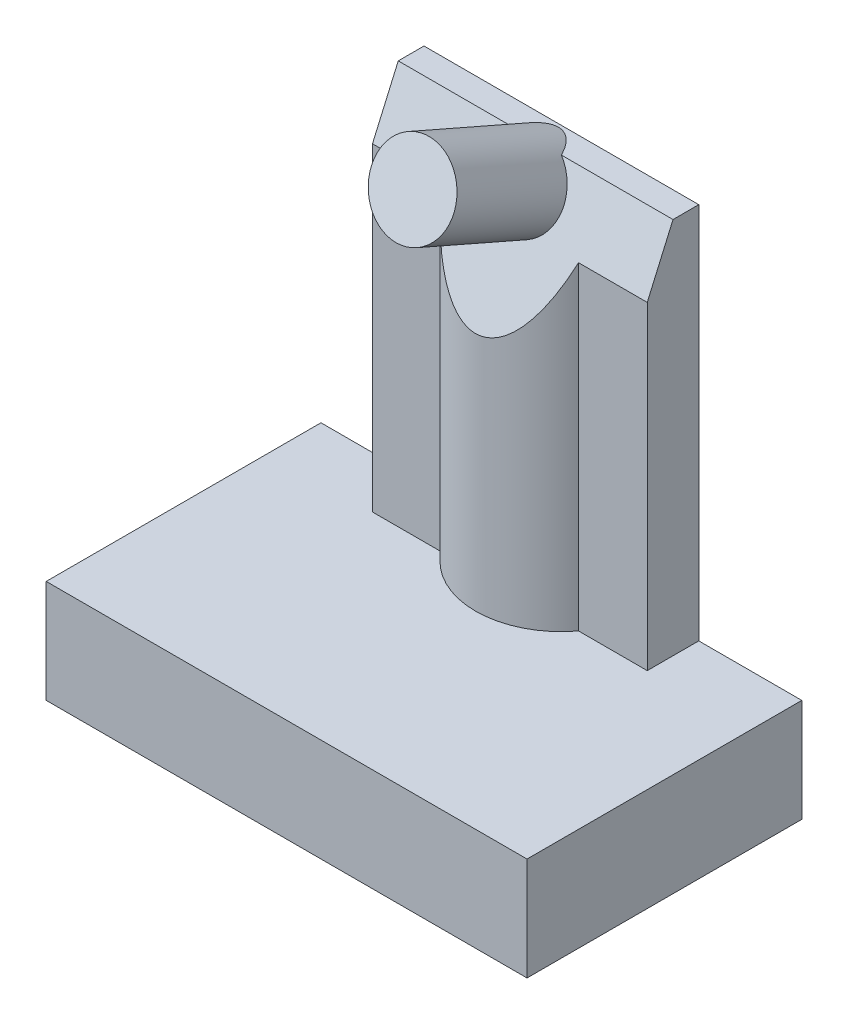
from build123d import *

# Parameters (mm, degrees)
CROQUIS1_W                          = 14
CROQUIS1_H                          = 8
SALIENTE_EXTRUIR1_DEPTH             = 3
VACIADO1_T                          = -1
CROQUIS2_R                          = 1.5
CROQUIS2_R_2                        = 0.8
SALIENTE_EXTRUIR2_DEPTH             = 2
SALIENTE_EXTRUIR4_DEPTH             = 11
CORTAR_EXTRUIR1_REACH               = 20.248
SALIENTE_EXTRUIR5_REACH             = 18.052
CROQUIS9_R                          = 1.2
SALIENTE_EXTRUIR5_DIRECTION_2_DEPTH = 3.5


with BuildPart() as part:
    # Croquis1 → Saliente-Extruir1 (new body)
    with BuildSketch(Plane(origin=(0, 0, 0), x_dir=(1, 0, 0), z_dir=(0, 1, 0))):
        Rectangle(CROQUIS1_W, CROQUIS1_H)
    extrude(amount=SALIENTE_EXTRUIR1_DEPTH)

    # Vaciado1
    vaciado1_openings = [part.faces().sort_by_distance(p)[0] for p in [
        (0, 0, 0),
    ]]
    offset(amount=VACIADO1_T, openings=vaciado1_openings, kind=Kind.INTERSECTION)

    # Croquis2 → Saliente-Extruir2 (add)
    with BuildSketch(Plane.XZ.offset(-2)):
        with Locations(Location((0, 0, 0), (0, 0, 90))):
            Circle(CROQUIS2_R)
        with Locations(Location((0, 0, 0), (0, 0, 270))):
            Circle(CROQUIS2_R_2, mode=Mode.SUBTRACT)
    extrude(amount=SALIENTE_EXTRUIR2_DEPTH)

    # Croquis7 → Saliente-Extruir4 (add)
    with BuildSketch(Plane(origin=(0, 3, 0), x_dir=(1, 0, 0), z_dir=(0, 1, 0))):
        with BuildLine():
            Line((-4, 4), (4, 4))
            Line((4, 4), (4, 2.5))
            Line((4, 2.5), (2, 2.5))
            ThreePointArc((2, 2.5), (0, 1.5), (-2, 2.5))
            Line((-2, 2.5), (-4, 2.5))
            Line((-4, 2.5), (-4, 4))
        make_face()
    extrude(amount=SALIENTE_EXTRUIR4_DEPTH)

    # Cortar-Extruir1: up to this face of the body (flat: up to its plane)
    cortar_extruir1_end = Plane(part.part.faces().sort_by_distance((-4, 8.5, -3.25))[0])
    # Croquis8 → Cortar-Extruir1 (cut, up to the picked face)
    with BuildSketch(Plane(origin=(4, 0, 0), x_dir=(0, 0, -1), z_dir=(1, 0, 0)), mode=Mode.PRIVATE) as cortar_extruir1_sk1:
        Polygon((3.25, 14), (1.5, 14), (1.5, 10), align=None)
    cortar_extruir1_tool1 = split(extrude(cortar_extruir1_sk1.sketch, amount=-CORTAR_EXTRUIR1_REACH, mode=Mode.PRIVATE), bisect_by=cortar_extruir1_end, keep=Keep.BOTH, mode=Mode.PRIVATE)
    add(cortar_extruir1_tool1.solids().sort_by(Axis((4, 12.666667, -2.083333), (-1, 0, 0)))[0], mode=Mode.SUBTRACT)

    # Saliente-Extruir5: up to this face of the body (flat: up to its plane)
    saliente_extruir5_end = Plane(part.part.faces().sort_by_distance((0, 6.238461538, -4))[0])
    # Croquis9 → Saliente-Extruir5 (add, up to the picked face)
    with BuildSketch(Plane(origin=(0, 1.055737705, 2.413114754), x_dir=(1, 0, 0), z_dir=(0, 0.4008188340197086, 0.9161573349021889)), mode=Mode.PRIVATE) as saliente_extruir5_sk1:
        with Locations(Location((0, 13.193279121, 0), (0, 0, 51.228905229))):
            Circle(CROQUIS9_R)
    saliente_extruir5_tool1 = split(extrude(saliente_extruir5_sk1.sketch, amount=-SALIENTE_EXTRUIR5_REACH, mode=Mode.PRIVATE), bisect_by=saliente_extruir5_end, keep=Keep.BOTH, mode=Mode.PRIVATE)
    add(saliente_extruir5_tool1.solids().sort_by(Axis((0, 13.142857, -2.875), (0, -0.4008188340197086, -0.9161573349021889)))[0])

    # Croquis9 → Saliente-Extruir5 direction 2 (add)
    with BuildSketch(Plane(origin=(0, 1.055737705, 2.413114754), x_dir=(1, 0, 0), z_dir=(0, 0.4008188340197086, 0.9161573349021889))):
        with Locations(Location((0, 13.193279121, 0), (0, 0, 51.228905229))):
            Circle(CROQUIS9_R)
    extrude(amount=SALIENTE_EXTRUIR5_DIRECTION_2_DEPTH)


solid = part.part
